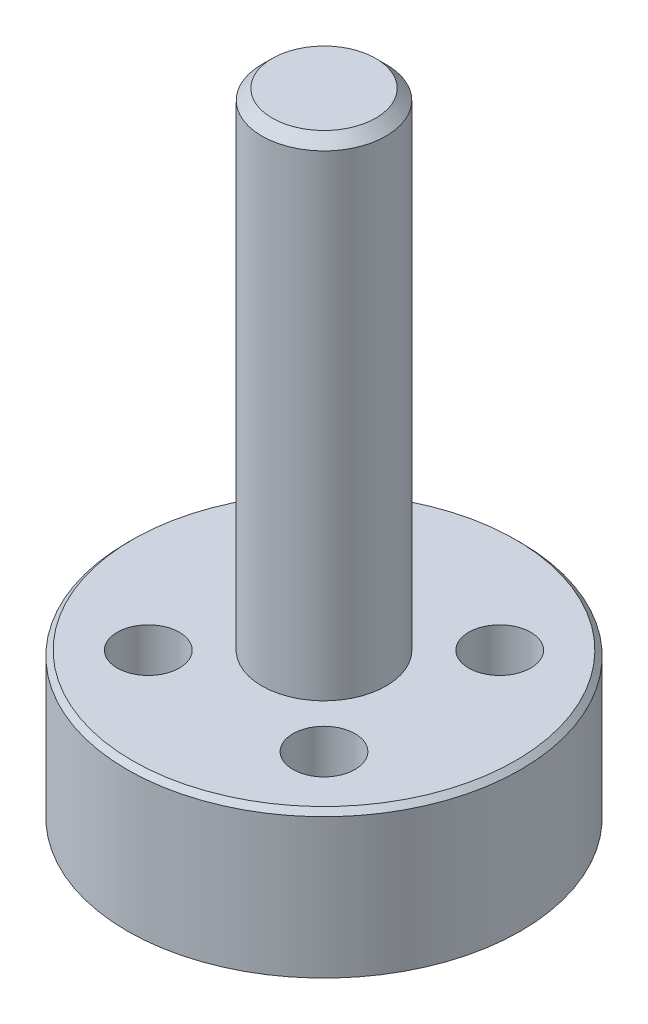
ISO-10303-21;
HEADER;
FILE_DESCRIPTION(('STEP AP214'),'2;1');
FILE_NAME('part.step','',(''),(''),'','','');
FILE_SCHEMA(('AUTOMOTIVE_DESIGN { 1 0 10303 214 1 1 1 1 }'));
ENDSEC;
DATA;
#1=APPLICATION_CONTEXT('core data for automotive mechanical design processes');
#2=APPLICATION_PROTOCOL_DEFINITION('international standard','automotive_design',2000,#1);
#3=PRODUCT_CONTEXT('',#1,'mechanical');
#4=PRODUCT('Part','Part','',(#3));
#5=PRODUCT_RELATED_PRODUCT_CATEGORY('part','',(#4));
#6=PRODUCT_DEFINITION_FORMATION('','',#4);
#7=PRODUCT_DEFINITION_CONTEXT('part definition',#1,'design');
#8=PRODUCT_DEFINITION('design','',#6,#7);
#9=PRODUCT_DEFINITION_SHAPE('','',#8);
#10=(LENGTH_UNIT() NAMED_UNIT(*) SI_UNIT(.MILLI.,.METRE.));
#11=(NAMED_UNIT(*) PLANE_ANGLE_UNIT() SI_UNIT($,.RADIAN.));
#12=(NAMED_UNIT(*) SI_UNIT($,.STERADIAN.) SOLID_ANGLE_UNIT());
#13=UNCERTAINTY_MEASURE_WITH_UNIT(LENGTH_MEASURE(1.E-05),#10,'distance_accuracy_value','');
#14=(GEOMETRIC_REPRESENTATION_CONTEXT(3) GLOBAL_UNCERTAINTY_ASSIGNED_CONTEXT((#13)) GLOBAL_UNIT_ASSIGNED_CONTEXT((#10,
#11,#12)) REPRESENTATION_CONTEXT('',''));
#15=CARTESIAN_POINT('',(0.,0.,0.));
#16=DIRECTION('',(0.,0.,1.));
#17=DIRECTION('',(1.,0.,0.));
#18=AXIS2_PLACEMENT_3D('',#15,#16,#17);
#19=CARTESIAN_POINT('',(0.,7.,0.));
#20=DIRECTION('',(0.,1.,0.));
#21=DIRECTION('',(0.,0.,1.));
#22=AXIS2_PLACEMENT_3D('',#19,#20,#21);
#23=PLANE('',#22);
#24=CARTESIAN_POINT('',(0.,7.,0.));
#25=DIRECTION('',(0.,1.,0.));
#26=DIRECTION('',(0.,0.,1.));
#27=AXIS2_PLACEMENT_3D('',#24,#25,#26);
#28=CIRCLE('',#27,9.25);
#29=CARTESIAN_POINT('',(0.,7.,9.25));
#30=VERTEX_POINT('',#29);
#31=EDGE_CURVE('E47',#30,#30,#28,.T.);
#32=ORIENTED_EDGE('',*,*,#31,.T.);
#33=EDGE_LOOP('',(#32));
#34=FACE_BOUND('',#33,.T.);
#35=CARTESIAN_POINT('',(0.,7.,0.));
#36=DIRECTION('',(0.,1.,0.));
#37=DIRECTION('',(0.,0.,1.));
#38=AXIS2_PLACEMENT_3D('',#35,#36,#37);
#39=CIRCLE('',#38,3.);
#40=CARTESIAN_POINT('',(0.,7.,3.));
#41=VERTEX_POINT('',#40);
#42=EDGE_CURVE('E96',#41,#41,#39,.T.);
#43=ORIENTED_EDGE('',*,*,#42,.F.);
#44=EDGE_LOOP('',(#43));
#45=FACE_BOUND('',#44,.T.);
#46=CARTESIAN_POINT('',(-4.24264068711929,7.,4.24264068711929));
#47=DIRECTION('',(0.,1.,0.));
#48=DIRECTION('',(0.,0.,1.));
#49=AXIS2_PLACEMENT_3D('',#46,#47,#48);
#50=CIRCLE('',#49,1.5);
#51=CARTESIAN_POINT('',(-4.24264068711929,7.,5.74264068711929));
#52=VERTEX_POINT('',#51);
#53=EDGE_CURVE('E80',#52,#52,#50,.T.);
#54=ORIENTED_EDGE('',*,*,#53,.F.);
#55=EDGE_LOOP('',(#54));
#56=FACE_BOUND('',#55,.T.);
#57=CARTESIAN_POINT('',(4.24264068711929,7.,-4.24264068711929));
#58=DIRECTION('',(0.,1.,0.));
#59=DIRECTION('',(0.,0.,1.));
#60=AXIS2_PLACEMENT_3D('',#57,#58,#59);
#61=CIRCLE('',#60,1.5);
#62=CARTESIAN_POINT('',(4.24264068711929,7.,-2.74264068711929));
#63=VERTEX_POINT('',#62);
#64=EDGE_CURVE('E67',#63,#63,#61,.T.);
#65=ORIENTED_EDGE('',*,*,#64,.F.);
#66=EDGE_LOOP('',(#65));
#67=FACE_BOUND('',#66,.T.);
#68=CARTESIAN_POINT('',(-4.24264068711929,7.,-4.24264068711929));
#69=DIRECTION('',(0.,1.,0.));
#70=DIRECTION('',(0.,0.,1.));
#71=AXIS2_PLACEMENT_3D('',#68,#69,#70);
#72=CIRCLE('',#71,1.5);
#73=CARTESIAN_POINT('',(-4.24264068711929,7.,-2.74264068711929));
#74=VERTEX_POINT('',#73);
#75=EDGE_CURVE('E72',#74,#74,#72,.T.);
#76=ORIENTED_EDGE('',*,*,#75,.F.);
#77=EDGE_LOOP('',(#76));
#78=FACE_BOUND('',#77,.T.);
#79=CARTESIAN_POINT('',(4.24264068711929,7.,4.24264068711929));
#80=DIRECTION('',(0.,1.,0.));
#81=DIRECTION('',(0.,0.,1.));
#82=AXIS2_PLACEMENT_3D('',#79,#80,#81);
#83=CIRCLE('',#82,1.5);
#84=CARTESIAN_POINT('',(4.24264068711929,7.,5.74264068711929));
#85=VERTEX_POINT('',#84);
#86=EDGE_CURVE('E88',#85,#85,#83,.T.);
#87=ORIENTED_EDGE('',*,*,#86,.F.);
#88=EDGE_LOOP('',(#87));
#89=FACE_BOUND('',#88,.T.);
#90=ADVANCED_FACE('F38',(#34,#45,#56,#67,#78,#89),#23,.T.);
#91=CARTESIAN_POINT('',(0.,0.,0.));
#92=DIRECTION('',(0.,1.,0.));
#93=DIRECTION('',(0.,0.,1.));
#94=AXIS2_PLACEMENT_3D('',#91,#92,#93);
#95=PLANE('',#94);
#96=CARTESIAN_POINT('',(0.,0.,0.));
#97=DIRECTION('',(0.,-1.,0.));
#98=DIRECTION('',(0.,0.,-1.));
#99=AXIS2_PLACEMENT_3D('',#96,#97,#98);
#100=CIRCLE('',#99,2.5);
#101=CARTESIAN_POINT('',(0.,0.,-2.5));
#102=VERTEX_POINT('',#101);
#103=EDGE_CURVE('E104',#102,#102,#100,.T.);
#104=ORIENTED_EDGE('',*,*,#103,.F.);
#105=EDGE_LOOP('',(#104));
#106=FACE_BOUND('',#105,.T.);
#107=CARTESIAN_POINT('',(0.,0.,0.));
#108=DIRECTION('',(0.,1.,0.));
#109=DIRECTION('',(0.,0.,1.));
#110=AXIS2_PLACEMENT_3D('',#107,#108,#109);
#111=CIRCLE('',#110,9.5);
#112=CARTESIAN_POINT('',(0.,0.,9.5));
#113=VERTEX_POINT('',#112);
#114=EDGE_CURVE('E63',#113,#113,#111,.T.);
#115=ORIENTED_EDGE('',*,*,#114,.F.);
#116=EDGE_LOOP('',(#115));
#117=FACE_BOUND('',#116,.T.);
#118=CARTESIAN_POINT('',(4.24264068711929,0.,-4.24264068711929));
#119=DIRECTION('',(0.,1.,0.));
#120=DIRECTION('',(0.,0.,1.));
#121=AXIS2_PLACEMENT_3D('',#118,#119,#120);
#122=CIRCLE('',#121,1.5);
#123=CARTESIAN_POINT('',(4.24264068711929,0.,-2.74264068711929));
#124=VERTEX_POINT('',#123);
#125=EDGE_CURVE('E68',#124,#124,#122,.T.);
#126=ORIENTED_EDGE('',*,*,#125,.T.);
#127=EDGE_LOOP('',(#126));
#128=FACE_BOUND('',#127,.T.);
#129=CARTESIAN_POINT('',(-4.24264068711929,0.,-4.24264068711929));
#130=DIRECTION('',(0.,1.,0.));
#131=DIRECTION('',(0.,0.,1.));
#132=AXIS2_PLACEMENT_3D('',#129,#130,#131);
#133=CIRCLE('',#132,1.5);
#134=CARTESIAN_POINT('',(-4.24264068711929,0.,-2.74264068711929));
#135=VERTEX_POINT('',#134);
#136=EDGE_CURVE('E76',#135,#135,#133,.T.);
#137=ORIENTED_EDGE('',*,*,#136,.T.);
#138=EDGE_LOOP('',(#137));
#139=FACE_BOUND('',#138,.T.);
#140=CARTESIAN_POINT('',(-4.24264068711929,0.,4.24264068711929));
#141=DIRECTION('',(0.,1.,0.));
#142=DIRECTION('',(0.,0.,1.));
#143=AXIS2_PLACEMENT_3D('',#140,#141,#142);
#144=CIRCLE('',#143,1.5);
#145=CARTESIAN_POINT('',(-4.24264068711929,0.,5.74264068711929));
#146=VERTEX_POINT('',#145);
#147=EDGE_CURVE('E84',#146,#146,#144,.T.);
#148=ORIENTED_EDGE('',*,*,#147,.T.);
#149=EDGE_LOOP('',(#148));
#150=FACE_BOUND('',#149,.T.);
#151=CARTESIAN_POINT('',(4.24264068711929,0.,4.24264068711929));
#152=DIRECTION('',(0.,1.,0.));
#153=DIRECTION('',(0.,0.,1.));
#154=AXIS2_PLACEMENT_3D('',#151,#152,#153);
#155=CIRCLE('',#154,1.5);
#156=CARTESIAN_POINT('',(4.24264068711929,0.,5.74264068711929));
#157=VERTEX_POINT('',#156);
#158=EDGE_CURVE('E92',#157,#157,#155,.T.);
#159=ORIENTED_EDGE('',*,*,#158,.T.);
#160=EDGE_LOOP('',(#159));
#161=FACE_BOUND('',#160,.T.);
#162=ADVANCED_FACE('F120',(#106,#117,#128,#139,#150,#161),#95,.F.);
#163=CARTESIAN_POINT('',(0.,7.,0.));
#164=DIRECTION('',(0.,-1.,0.));
#165=DIRECTION('',(0.,0.,-1.));
#166=AXIS2_PLACEMENT_3D('',#163,#164,#165);
#167=CYLINDRICAL_SURFACE('',#166,9.5);
#168=CARTESIAN_POINT('',(0.,6.75,0.));
#169=DIRECTION('',(0.,1.,0.));
#170=DIRECTION('',(0.,0.,1.));
#171=AXIS2_PLACEMENT_3D('',#168,#169,#170);
#172=CIRCLE('',#171,9.5);
#173=CARTESIAN_POINT('',(0.,6.75,9.5));
#174=VERTEX_POINT('',#173);
#175=EDGE_CURVE('E10',#174,#174,#172,.F.);
#176=ORIENTED_EDGE('',*,*,#175,.T.);
#177=EDGE_LOOP('',(#176));
#178=FACE_BOUND('',#177,.T.);
#179=ORIENTED_EDGE('',*,*,#114,.T.);
#180=EDGE_LOOP('',(#179));
#181=FACE_BOUND('',#180,.T.);
#182=ADVANCED_FACE('F123',(#178,#181),#167,.T.);
#183=CARTESIAN_POINT('',(4.24264068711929,7.,-4.24264068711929));
#184=DIRECTION('',(0.,-1.,0.));
#185=DIRECTION('',(0.,0.,-1.));
#186=AXIS2_PLACEMENT_3D('',#183,#184,#185);
#187=CYLINDRICAL_SURFACE('',#186,1.5);
#188=ORIENTED_EDGE('',*,*,#64,.T.);
#189=EDGE_LOOP('',(#188));
#190=FACE_BOUND('',#189,.T.);
#191=ORIENTED_EDGE('',*,*,#125,.F.);
#192=EDGE_LOOP('',(#191));
#193=FACE_BOUND('',#192,.T.);
#194=ADVANCED_FACE('F157',(#190,#193),#187,.F.);
#195=CARTESIAN_POINT('',(-4.24264068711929,7.,-4.24264068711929));
#196=DIRECTION('',(0.,-1.,0.));
#197=DIRECTION('',(0.,0.,-1.));
#198=AXIS2_PLACEMENT_3D('',#195,#196,#197);
#199=CYLINDRICAL_SURFACE('',#198,1.5);
#200=ORIENTED_EDGE('',*,*,#75,.T.);
#201=EDGE_LOOP('',(#200));
#202=FACE_BOUND('',#201,.T.);
#203=ORIENTED_EDGE('',*,*,#136,.F.);
#204=EDGE_LOOP('',(#203));
#205=FACE_BOUND('',#204,.T.);
#206=ADVANCED_FACE('F148',(#202,#205),#199,.F.);
#207=CARTESIAN_POINT('',(-4.24264068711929,7.,4.24264068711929));
#208=DIRECTION('',(0.,-1.,0.));
#209=DIRECTION('',(0.,0.,-1.));
#210=AXIS2_PLACEMENT_3D('',#207,#208,#209);
#211=CYLINDRICAL_SURFACE('',#210,1.5);
#212=ORIENTED_EDGE('',*,*,#53,.T.);
#213=EDGE_LOOP('',(#212));
#214=FACE_BOUND('',#213,.T.);
#215=ORIENTED_EDGE('',*,*,#147,.F.);
#216=EDGE_LOOP('',(#215));
#217=FACE_BOUND('',#216,.T.);
#218=ADVANCED_FACE('F138',(#214,#217),#211,.F.);
#219=CARTESIAN_POINT('',(4.24264068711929,7.,4.24264068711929));
#220=DIRECTION('',(0.,-1.,0.));
#221=DIRECTION('',(0.,0.,-1.));
#222=AXIS2_PLACEMENT_3D('',#219,#220,#221);
#223=CYLINDRICAL_SURFACE('',#222,1.5);
#224=ORIENTED_EDGE('',*,*,#86,.T.);
#225=EDGE_LOOP('',(#224));
#226=FACE_BOUND('',#225,.T.);
#227=ORIENTED_EDGE('',*,*,#158,.F.);
#228=EDGE_LOOP('',(#227));
#229=FACE_BOUND('',#228,.T.);
#230=ADVANCED_FACE('F135',(#226,#229),#223,.F.);
#231=CARTESIAN_POINT('',(0.,30.5,0.));
#232=DIRECTION('',(0.,-1.,0.));
#233=DIRECTION('',(0.,0.,-1.));
#234=AXIS2_PLACEMENT_3D('',#231,#232,#233);
#235=CYLINDRICAL_SURFACE('',#234,3.);
#236=CARTESIAN_POINT('',(0.,30.,0.));
#237=DIRECTION('',(0.,1.,0.));
#238=DIRECTION('',(0.,0.,1.));
#239=AXIS2_PLACEMENT_3D('',#236,#237,#238);
#240=CIRCLE('',#239,3.);
#241=CARTESIAN_POINT('',(0.,30.,3.));
#242=VERTEX_POINT('',#241);
#243=EDGE_CURVE('E52',#242,#242,#240,.F.);
#244=ORIENTED_EDGE('',*,*,#243,.T.);
#245=EDGE_LOOP('',(#244));
#246=FACE_BOUND('',#245,.T.);
#247=ORIENTED_EDGE('',*,*,#42,.T.);
#248=EDGE_LOOP('',(#247));
#249=FACE_BOUND('',#248,.T.);
#250=ADVANCED_FACE('F137',(#246,#249),#235,.T.);
#251=CARTESIAN_POINT('',(0.,30.5,0.));
#252=DIRECTION('',(0.,1.,0.));
#253=DIRECTION('',(0.,0.,1.));
#254=AXIS2_PLACEMENT_3D('',#251,#252,#253);
#255=PLANE('',#254);
#256=CARTESIAN_POINT('',(0.,30.5,0.));
#257=DIRECTION('',(0.,1.,0.));
#258=DIRECTION('',(0.,0.,1.));
#259=AXIS2_PLACEMENT_3D('',#256,#257,#258);
#260=CIRCLE('',#259,2.5);
#261=CARTESIAN_POINT('',(0.,30.5,2.5));
#262=VERTEX_POINT('',#261);
#263=EDGE_CURVE('E57',#262,#262,#260,.T.);
#264=ORIENTED_EDGE('',*,*,#263,.T.);
#265=EDGE_LOOP('',(#264));
#266=FACE_BOUND('',#265,.T.);
#267=ADVANCED_FACE('F145',(#266),#255,.T.);
#268=CARTESIAN_POINT('',(0.,30.5,0.));
#269=DIRECTION('',(0.,-1.,0.));
#270=DIRECTION('',(0.,0.,-1.));
#271=AXIS2_PLACEMENT_3D('',#268,#269,#270);
#272=CONICAL_SURFACE('',#271,2.5,0.785398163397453);
#273=ORIENTED_EDGE('',*,*,#243,.F.);
#274=EDGE_LOOP('',(#273));
#275=FACE_BOUND('',#274,.T.);
#276=ORIENTED_EDGE('',*,*,#263,.F.);
#277=EDGE_LOOP('',(#276));
#278=FACE_BOUND('',#277,.T.);
#279=ADVANCED_FACE('F162',(#275,#278),#272,.T.);
#280=CARTESIAN_POINT('',(0.,7.,0.));
#281=DIRECTION('',(0.,-1.,0.));
#282=DIRECTION('',(0.,0.,-1.));
#283=AXIS2_PLACEMENT_3D('',#280,#281,#282);
#284=CONICAL_SURFACE('',#283,9.25,0.785398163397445);
#285=ORIENTED_EDGE('',*,*,#175,.F.);
#286=EDGE_LOOP('',(#285));
#287=FACE_BOUND('',#286,.T.);
#288=ORIENTED_EDGE('',*,*,#31,.F.);
#289=EDGE_LOOP('',(#288));
#290=FACE_BOUND('',#289,.T.);
#291=ADVANCED_FACE('F41',(#287,#290),#284,.T.);
#292=CARTESIAN_POINT('',(0.,5.,0.));
#293=DIRECTION('',(0.,-1.,0.));
#294=DIRECTION('',(0.,0.,-1.));
#295=AXIS2_PLACEMENT_3D('',#292,#293,#294);
#296=CYLINDRICAL_SURFACE('',#295,2.5);
#297=CARTESIAN_POINT('',(0.,5.,0.));
#298=DIRECTION('',(0.,-1.,0.));
#299=DIRECTION('',(0.,0.,-1.));
#300=AXIS2_PLACEMENT_3D('',#297,#298,#299);
#301=CIRCLE('',#300,2.5);
#302=CARTESIAN_POINT('',(0.,5.,-2.5));
#303=VERTEX_POINT('',#302);
#304=EDGE_CURVE('E103',#303,#303,#301,.T.);
#305=ORIENTED_EDGE('',*,*,#304,.F.);
#306=EDGE_LOOP('',(#305));
#307=FACE_BOUND('',#306,.T.);
#308=ORIENTED_EDGE('',*,*,#103,.T.);
#309=EDGE_LOOP('',(#308));
#310=FACE_BOUND('',#309,.T.);
#311=ADVANCED_FACE('F114',(#307,#310),#296,.F.);
#312=CARTESIAN_POINT('',(0.,5.,0.));
#313=DIRECTION('',(0.,-1.,0.));
#314=DIRECTION('',(0.,0.,-1.));
#315=AXIS2_PLACEMENT_3D('',#312,#313,#314);
#316=PLANE('',#315);
#317=ORIENTED_EDGE('',*,*,#304,.T.);
#318=EDGE_LOOP('',(#317));
#319=FACE_BOUND('',#318,.T.);
#320=ADVANCED_FACE('F112',(#319),#316,.T.);
#321=CLOSED_SHELL('',(#90,#162,#182,#194,#206,#218,#230,#250,#267,#279,#291,#311,#320));
#322=MANIFOLD_SOLID_BREP('B2',#321);
#323=ADVANCED_BREP_SHAPE_REPRESENTATION('',(#18,#322),#14);
#324=SHAPE_DEFINITION_REPRESENTATION(#9,#323);
ENDSEC;
END-ISO-10303-21;
